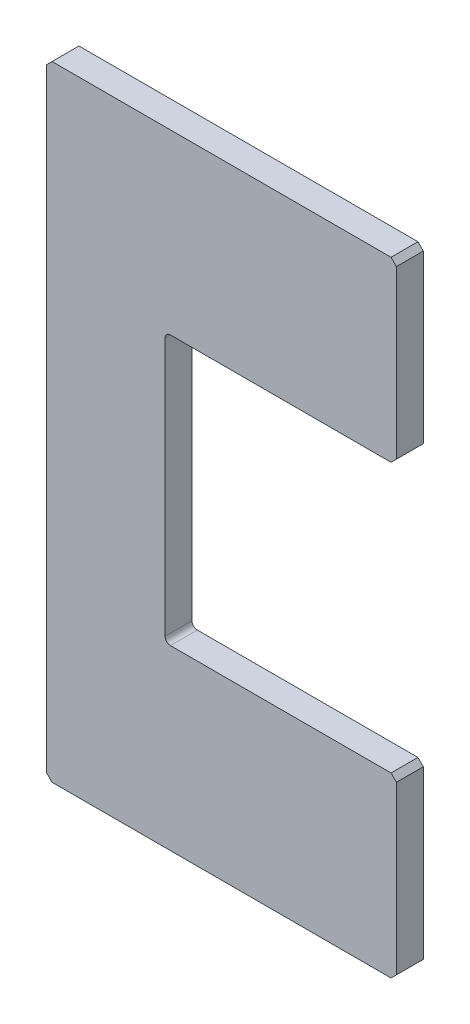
ISO-10303-21;
HEADER;
FILE_DESCRIPTION(('STEP AP214'),'2;1');
FILE_NAME('part.step','',(''),(''),'','','');
FILE_SCHEMA(('AUTOMOTIVE_DESIGN { 1 0 10303 214 1 1 1 1 }'));
ENDSEC;
DATA;
#1=APPLICATION_CONTEXT('core data for automotive mechanical design processes');
#2=APPLICATION_PROTOCOL_DEFINITION('international standard','automotive_design',2000,#1);
#3=PRODUCT_CONTEXT('',#1,'mechanical');
#4=PRODUCT('Part','Part','',(#3));
#5=PRODUCT_RELATED_PRODUCT_CATEGORY('part','',(#4));
#6=PRODUCT_DEFINITION_FORMATION('','',#4);
#7=PRODUCT_DEFINITION_CONTEXT('part definition',#1,'design');
#8=PRODUCT_DEFINITION('design','',#6,#7);
#9=PRODUCT_DEFINITION_SHAPE('','',#8);
#10=(LENGTH_UNIT() NAMED_UNIT(*) SI_UNIT(.MILLI.,.METRE.));
#11=(NAMED_UNIT(*) PLANE_ANGLE_UNIT() SI_UNIT($,.RADIAN.));
#12=(NAMED_UNIT(*) SI_UNIT($,.STERADIAN.) SOLID_ANGLE_UNIT());
#13=UNCERTAINTY_MEASURE_WITH_UNIT(LENGTH_MEASURE(1.E-05),#10,'distance_accuracy_value','');
#14=(GEOMETRIC_REPRESENTATION_CONTEXT(3) GLOBAL_UNCERTAINTY_ASSIGNED_CONTEXT((#13)) GLOBAL_UNIT_ASSIGNED_CONTEXT((#10,
#11,#12)) REPRESENTATION_CONTEXT('',''));
#15=CARTESIAN_POINT('',(0.,0.,0.));
#16=DIRECTION('',(0.,0.,1.));
#17=DIRECTION('',(1.,0.,0.));
#18=AXIS2_PLACEMENT_3D('',#15,#16,#17);
#19=CARTESIAN_POINT('',(0.,-11.6,0.5));
#20=DIRECTION('',(1.,0.,0.));
#21=DIRECTION('',(0.,0.,-1.));
#22=AXIS2_PLACEMENT_3D('',#19,#20,#21);
#23=PLANE('',#22);
#24=DIRECTION('',(0.,-1.,0.));
#25=VECTOR('',#24,1.);
#26=CARTESIAN_POINT('',(0.,-11.6,0.5));
#27=LINE('',#26,#25);
#28=CARTESIAN_POINT('',(0.,-0.0999999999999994,0.5));
#29=VERTEX_POINT('',#28);
#30=CARTESIAN_POINT('',(0.,-11.5,0.5));
#31=VERTEX_POINT('',#30);
#32=EDGE_CURVE('E212',#29,#31,#27,.T.);
#33=ORIENTED_EDGE('',*,*,#32,.F.);
#34=DIRECTION('',(0.,0.,-1.));
#35=VECTOR('',#34,1.);
#36=CARTESIAN_POINT('',(0.,-0.0999999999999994,0.5));
#37=LINE('',#36,#35);
#38=CARTESIAN_POINT('',(0.,-0.0999999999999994,0.));
#39=VERTEX_POINT('',#38);
#40=EDGE_CURVE('E231',#29,#39,#37,.T.);
#41=ORIENTED_EDGE('',*,*,#40,.T.);
#42=DIRECTION('',(0.,-1.,0.));
#43=VECTOR('',#42,1.);
#44=CARTESIAN_POINT('',(0.,-11.6,0.));
#45=LINE('',#44,#43);
#46=CARTESIAN_POINT('',(0.,-11.5,0.));
#47=VERTEX_POINT('',#46);
#48=EDGE_CURVE('E327',#39,#47,#45,.T.);
#49=ORIENTED_EDGE('',*,*,#48,.T.);
#50=DIRECTION('',(0.,0.,1.));
#51=VECTOR('',#50,1.);
#52=CARTESIAN_POINT('',(0.,-11.5,0.5));
#53=LINE('',#52,#51);
#54=EDGE_CURVE('E228',#47,#31,#53,.T.);
#55=ORIENTED_EDGE('',*,*,#54,.T.);
#56=EDGE_LOOP('',(#33,#41,#49,#55));
#57=FACE_BOUND('',#56,.T.);
#58=ADVANCED_FACE('F47',(#57),#23,.F.);
#59=CARTESIAN_POINT('',(6.5,-11.6,0.5));
#60=DIRECTION('',(0.,1.,0.));
#61=DIRECTION('',(0.,0.,1.));
#62=AXIS2_PLACEMENT_3D('',#59,#60,#61);
#63=PLANE('',#62);
#64=DIRECTION('',(1.,0.,0.));
#65=VECTOR('',#64,1.);
#66=CARTESIAN_POINT('',(6.5,-11.6,0.5));
#67=LINE('',#66,#65);
#68=CARTESIAN_POINT('',(0.0999999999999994,-11.6,0.5));
#69=VERTEX_POINT('',#68);
#70=CARTESIAN_POINT('',(6.4,-11.6,0.5));
#71=VERTEX_POINT('',#70);
#72=EDGE_CURVE('E316',#69,#71,#67,.T.);
#73=ORIENTED_EDGE('',*,*,#72,.F.);
#74=DIRECTION('',(0.,0.,-1.));
#75=VECTOR('',#74,1.);
#76=CARTESIAN_POINT('',(0.0999999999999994,-11.6,0.5));
#77=LINE('',#76,#75);
#78=CARTESIAN_POINT('',(0.0999999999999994,-11.6,0.));
#79=VERTEX_POINT('',#78);
#80=EDGE_CURVE('E280',#69,#79,#77,.T.);
#81=ORIENTED_EDGE('',*,*,#80,.T.);
#82=DIRECTION('',(1.,0.,0.));
#83=VECTOR('',#82,1.);
#84=CARTESIAN_POINT('',(6.5,-11.6,0.));
#85=LINE('',#84,#83);
#86=CARTESIAN_POINT('',(6.4,-11.6,0.));
#87=VERTEX_POINT('',#86);
#88=EDGE_CURVE('E325',#79,#87,#85,.T.);
#89=ORIENTED_EDGE('',*,*,#88,.T.);
#90=DIRECTION('',(0.,0.,1.));
#91=VECTOR('',#90,1.);
#92=CARTESIAN_POINT('',(6.4,-11.6,0.5));
#93=LINE('',#92,#91);
#94=EDGE_CURVE('E277',#87,#71,#93,.T.);
#95=ORIENTED_EDGE('',*,*,#94,.T.);
#96=EDGE_LOOP('',(#73,#81,#89,#95));
#97=FACE_BOUND('',#96,.T.);
#98=ADVANCED_FACE('F360',(#97),#63,.F.);
#99=CARTESIAN_POINT('',(6.5,-8.3,0.5));
#100=DIRECTION('',(-1.,0.,0.));
#101=DIRECTION('',(0.,-1.,0.));
#102=AXIS2_PLACEMENT_3D('',#99,#100,#101);
#103=PLANE('',#102);
#104=DIRECTION('',(0.,1.,0.));
#105=VECTOR('',#104,1.);
#106=CARTESIAN_POINT('',(6.5,-8.3,0.));
#107=LINE('',#106,#105);
#108=CARTESIAN_POINT('',(6.5,-11.5,0.));
#109=VERTEX_POINT('',#108);
#110=CARTESIAN_POINT('',(6.5,-8.4,0.));
#111=VERTEX_POINT('',#110);
#112=EDGE_CURVE('E202',#109,#111,#107,.T.);
#113=ORIENTED_EDGE('',*,*,#112,.T.);
#114=DIRECTION('',(0.,0.,1.));
#115=VECTOR('',#114,1.);
#116=CARTESIAN_POINT('',(6.5,-8.4,0.5));
#117=LINE('',#116,#115);
#118=CARTESIAN_POINT('',(6.5,-8.4,0.5));
#119=VERTEX_POINT('',#118);
#120=EDGE_CURVE('E57',#111,#119,#117,.T.);
#121=ORIENTED_EDGE('',*,*,#120,.T.);
#122=DIRECTION('',(0.,1.,0.));
#123=VECTOR('',#122,1.);
#124=CARTESIAN_POINT('',(6.5,-8.3,0.5));
#125=LINE('',#124,#123);
#126=CARTESIAN_POINT('',(6.5,-11.5,0.5));
#127=VERTEX_POINT('',#126);
#128=EDGE_CURVE('E304',#127,#119,#125,.T.);
#129=ORIENTED_EDGE('',*,*,#128,.F.);
#130=DIRECTION('',(0.,0.,-1.));
#131=VECTOR('',#130,1.);
#132=CARTESIAN_POINT('',(6.5,-11.5,0.5));
#133=LINE('',#132,#131);
#134=EDGE_CURVE('E294',#127,#109,#133,.T.);
#135=ORIENTED_EDGE('',*,*,#134,.T.);
#136=EDGE_LOOP('',(#113,#121,#129,#135));
#137=FACE_BOUND('',#136,.T.);
#138=ADVANCED_FACE('F303',(#137),#103,.F.);
#139=CARTESIAN_POINT('',(2.2,-8.3,0.5));
#140=DIRECTION('',(0.,-1.,0.));
#141=DIRECTION('',(0.,0.,-1.));
#142=AXIS2_PLACEMENT_3D('',#139,#140,#141);
#143=PLANE('',#142);
#144=DIRECTION('',(-1.,0.,0.));
#145=VECTOR('',#144,1.);
#146=CARTESIAN_POINT('',(2.2,-8.3,0.5));
#147=LINE('',#146,#145);
#148=CARTESIAN_POINT('',(6.4,-8.3,0.5));
#149=VERTEX_POINT('',#148);
#150=CARTESIAN_POINT('',(2.3,-8.3,0.5));
#151=VERTEX_POINT('',#150);
#152=EDGE_CURVE('E315',#149,#151,#147,.T.);
#153=ORIENTED_EDGE('',*,*,#152,.F.);
#154=DIRECTION('',(0.,0.,-1.));
#155=VECTOR('',#154,1.);
#156=CARTESIAN_POINT('',(6.4,-8.3,0.5));
#157=LINE('',#156,#155);
#158=CARTESIAN_POINT('',(6.4,-8.3,0.));
#159=VERTEX_POINT('',#158);
#160=EDGE_CURVE('E290',#149,#159,#157,.T.);
#161=ORIENTED_EDGE('',*,*,#160,.T.);
#162=DIRECTION('',(-1.,0.,0.));
#163=VECTOR('',#162,1.);
#164=CARTESIAN_POINT('',(2.2,-8.3,0.));
#165=LINE('',#164,#163);
#166=CARTESIAN_POINT('',(2.3,-8.3,0.));
#167=VERTEX_POINT('',#166);
#168=EDGE_CURVE('E195',#159,#167,#165,.T.);
#169=ORIENTED_EDGE('',*,*,#168,.T.);
#170=DIRECTION('',(0.,0.,-1.));
#171=VECTOR('',#170,1.);
#172=CARTESIAN_POINT('',(2.3,-8.3,0.5));
#173=LINE('',#172,#171);
#174=EDGE_CURVE('E170',#167,#151,#173,.F.);
#175=ORIENTED_EDGE('',*,*,#174,.T.);
#176=EDGE_LOOP('',(#153,#161,#169,#175));
#177=FACE_BOUND('',#176,.T.);
#178=ADVANCED_FACE('F321',(#177),#143,.F.);
#179=CARTESIAN_POINT('',(2.2,-3.3,0.5));
#180=DIRECTION('',(-1.,0.,0.));
#181=DIRECTION('',(0.,-1.,0.));
#182=AXIS2_PLACEMENT_3D('',#179,#180,#181);
#183=PLANE('',#182);
#184=DIRECTION('',(0.,1.,0.));
#185=VECTOR('',#184,1.);
#186=CARTESIAN_POINT('',(2.2,-3.3,0.5));
#187=LINE('',#186,#185);
#188=CARTESIAN_POINT('',(2.2,-8.2,0.5));
#189=VERTEX_POINT('',#188);
#190=CARTESIAN_POINT('',(2.2,-3.4,0.5));
#191=VERTEX_POINT('',#190);
#192=EDGE_CURVE('E185',#189,#191,#187,.T.);
#193=ORIENTED_EDGE('',*,*,#192,.F.);
#194=DIRECTION('',(0.,0.,-1.));
#195=VECTOR('',#194,1.);
#196=CARTESIAN_POINT('',(2.2,-8.2,0.));
#197=LINE('',#196,#195);
#198=CARTESIAN_POINT('',(2.2,-8.2,0.));
#199=VERTEX_POINT('',#198);
#200=EDGE_CURVE('E168',#189,#199,#197,.T.);
#201=ORIENTED_EDGE('',*,*,#200,.T.);
#202=DIRECTION('',(0.,1.,0.));
#203=VECTOR('',#202,1.);
#204=CARTESIAN_POINT('',(2.2,-3.3,0.));
#205=LINE('',#204,#203);
#206=CARTESIAN_POINT('',(2.2,-3.4,0.));
#207=VERTEX_POINT('',#206);
#208=EDGE_CURVE('E182',#199,#207,#205,.T.);
#209=ORIENTED_EDGE('',*,*,#208,.T.);
#210=DIRECTION('',(0.,0.,-1.));
#211=VECTOR('',#210,1.);
#212=CARTESIAN_POINT('',(2.2,-3.4,0.5));
#213=LINE('',#212,#211);
#214=EDGE_CURVE('E187',#207,#191,#213,.F.);
#215=ORIENTED_EDGE('',*,*,#214,.T.);
#216=EDGE_LOOP('',(#193,#201,#209,#215));
#217=FACE_BOUND('',#216,.T.);
#218=ADVANCED_FACE('F181',(#217),#183,.F.);
#219=CARTESIAN_POINT('',(6.5,-3.3,0.5));
#220=DIRECTION('',(0.,1.,0.));
#221=DIRECTION('',(-1.,0.,0.));
#222=AXIS2_PLACEMENT_3D('',#219,#220,#221);
#223=PLANE('',#222);
#224=DIRECTION('',(1.,0.,0.));
#225=VECTOR('',#224,1.);
#226=CARTESIAN_POINT('',(6.5,-3.3,0.));
#227=LINE('',#226,#225);
#228=CARTESIAN_POINT('',(2.3,-3.3,0.));
#229=VERTEX_POINT('',#228);
#230=CARTESIAN_POINT('',(6.4,-3.3,0.));
#231=VERTEX_POINT('',#230);
#232=EDGE_CURVE('E194',#229,#231,#227,.T.);
#233=ORIENTED_EDGE('',*,*,#232,.T.);
#234=DIRECTION('',(0.,0.,1.));
#235=VECTOR('',#234,1.);
#236=CARTESIAN_POINT('',(6.4,-3.3,0.5));
#237=LINE('',#236,#235);
#238=CARTESIAN_POINT('',(6.4,-3.3,0.5));
#239=VERTEX_POINT('',#238);
#240=EDGE_CURVE('E11',#231,#239,#237,.T.);
#241=ORIENTED_EDGE('',*,*,#240,.T.);
#242=DIRECTION('',(1.,0.,0.));
#243=VECTOR('',#242,1.);
#244=CARTESIAN_POINT('',(6.5,-3.3,0.5));
#245=LINE('',#244,#243);
#246=CARTESIAN_POINT('',(2.3,-3.3,0.5));
#247=VERTEX_POINT('',#246);
#248=EDGE_CURVE('E338',#247,#239,#245,.T.);
#249=ORIENTED_EDGE('',*,*,#248,.F.);
#250=DIRECTION('',(0.,0.,-1.));
#251=VECTOR('',#250,1.);
#252=CARTESIAN_POINT('',(2.3,-3.3,0.));
#253=LINE('',#252,#251);
#254=EDGE_CURVE('E176',#247,#229,#253,.T.);
#255=ORIENTED_EDGE('',*,*,#254,.T.);
#256=EDGE_LOOP('',(#233,#241,#249,#255));
#257=FACE_BOUND('',#256,.T.);
#258=ADVANCED_FACE('F380',(#257),#223,.F.);
#259=CARTESIAN_POINT('',(6.5,0.,0.5));
#260=DIRECTION('',(-1.,0.,0.));
#261=DIRECTION('',(0.,0.,1.));
#262=AXIS2_PLACEMENT_3D('',#259,#260,#261);
#263=PLANE('',#262);
#264=DIRECTION('',(0.,1.,0.));
#265=VECTOR('',#264,1.);
#266=CARTESIAN_POINT('',(6.5,0.,0.));
#267=LINE('',#266,#265);
#268=CARTESIAN_POINT('',(6.5,-3.2,0.));
#269=VERTEX_POINT('',#268);
#270=CARTESIAN_POINT('',(6.5,-0.0999999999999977,0.));
#271=VERTEX_POINT('',#270);
#272=EDGE_CURVE('E200',#269,#271,#267,.T.);
#273=ORIENTED_EDGE('',*,*,#272,.T.);
#274=DIRECTION('',(0.,0.,1.));
#275=VECTOR('',#274,1.);
#276=CARTESIAN_POINT('',(6.5,-0.0999999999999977,0.5));
#277=LINE('',#276,#275);
#278=CARTESIAN_POINT('',(6.5,-0.0999999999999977,0.5));
#279=VERTEX_POINT('',#278);
#280=EDGE_CURVE('E64',#271,#279,#277,.T.);
#281=ORIENTED_EDGE('',*,*,#280,.T.);
#282=DIRECTION('',(0.,1.,0.));
#283=VECTOR('',#282,1.);
#284=CARTESIAN_POINT('',(6.5,0.,0.5));
#285=LINE('',#284,#283);
#286=CARTESIAN_POINT('',(6.5,-3.2,0.5));
#287=VERTEX_POINT('',#286);
#288=EDGE_CURVE('E335',#287,#279,#285,.T.);
#289=ORIENTED_EDGE('',*,*,#288,.F.);
#290=DIRECTION('',(0.,0.,-1.));
#291=VECTOR('',#290,1.);
#292=CARTESIAN_POINT('',(6.5,-3.2,0.5));
#293=LINE('',#292,#291);
#294=EDGE_CURVE('E284',#287,#269,#293,.T.);
#295=ORIENTED_EDGE('',*,*,#294,.T.);
#296=EDGE_LOOP('',(#273,#281,#289,#295));
#297=FACE_BOUND('',#296,.T.);
#298=ADVANCED_FACE('F374',(#297),#263,.F.);
#299=CARTESIAN_POINT('',(0.,0.,0.5));
#300=DIRECTION('',(0.,-1.,0.));
#301=DIRECTION('',(0.,0.,-1.));
#302=AXIS2_PLACEMENT_3D('',#299,#300,#301);
#303=PLANE('',#302);
#304=DIRECTION('',(-1.,0.,0.));
#305=VECTOR('',#304,1.);
#306=CARTESIAN_POINT('',(0.,0.,0.));
#307=LINE('',#306,#305);
#308=CARTESIAN_POINT('',(6.4,0.,0.));
#309=VERTEX_POINT('',#308);
#310=CARTESIAN_POINT('',(0.0999999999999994,0.,0.));
#311=VERTEX_POINT('',#310);
#312=EDGE_CURVE('E208',#309,#311,#307,.T.);
#313=ORIENTED_EDGE('',*,*,#312,.T.);
#314=DIRECTION('',(0.,0.,1.));
#315=VECTOR('',#314,1.);
#316=CARTESIAN_POINT('',(0.0999999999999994,0.,0.5));
#317=LINE('',#316,#315);
#318=CARTESIAN_POINT('',(0.0999999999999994,0.,0.5));
#319=VERTEX_POINT('',#318);
#320=EDGE_CURVE('E257',#311,#319,#317,.T.);
#321=ORIENTED_EDGE('',*,*,#320,.T.);
#322=DIRECTION('',(-1.,0.,0.));
#323=VECTOR('',#322,1.);
#324=CARTESIAN_POINT('',(0.,0.,0.5));
#325=LINE('',#324,#323);
#326=CARTESIAN_POINT('',(6.4,0.,0.5));
#327=VERTEX_POINT('',#326);
#328=EDGE_CURVE('E214',#327,#319,#325,.T.);
#329=ORIENTED_EDGE('',*,*,#328,.F.);
#330=DIRECTION('',(0.,0.,-1.));
#331=VECTOR('',#330,1.);
#332=CARTESIAN_POINT('',(6.4,0.,0.5));
#333=LINE('',#332,#331);
#334=EDGE_CURVE('E253',#327,#309,#333,.T.);
#335=ORIENTED_EDGE('',*,*,#334,.T.);
#336=EDGE_LOOP('',(#313,#321,#329,#335));
#337=FACE_BOUND('',#336,.T.);
#338=ADVANCED_FACE('F367',(#337),#303,.F.);
#339=CARTESIAN_POINT('',(0.,0.,0.5));
#340=DIRECTION('',(0.,0.,-1.));
#341=DIRECTION('',(-1.,0.,0.));
#342=AXIS2_PLACEMENT_3D('',#339,#340,#341);
#343=PLANE('',#342);
#344=ORIENTED_EDGE('',*,*,#328,.T.);
#345=DIRECTION('',(0.707106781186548,0.707106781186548,0.));
#346=VECTOR('',#345,1.);
#347=CARTESIAN_POINT('',(0.,-0.0999999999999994,0.5));
#348=LINE('',#347,#346);
#349=EDGE_CURVE('E274',#319,#29,#348,.F.);
#350=ORIENTED_EDGE('',*,*,#349,.T.);
#351=ORIENTED_EDGE('',*,*,#32,.T.);
#352=DIRECTION('',(-0.707106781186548,0.707106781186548,0.));
#353=VECTOR('',#352,1.);
#354=CARTESIAN_POINT('',(0.0999999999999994,-11.6,0.5));
#355=LINE('',#354,#353);
#356=EDGE_CURVE('E271',#31,#69,#355,.F.);
#357=ORIENTED_EDGE('',*,*,#356,.T.);
#358=ORIENTED_EDGE('',*,*,#72,.T.);
#359=DIRECTION('',(-0.707106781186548,-0.707106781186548,0.));
#360=VECTOR('',#359,1.);
#361=CARTESIAN_POINT('',(6.5,-11.5,0.5));
#362=LINE('',#361,#360);
#363=EDGE_CURVE('E260',#71,#127,#362,.F.);
#364=ORIENTED_EDGE('',*,*,#363,.T.);
#365=ORIENTED_EDGE('',*,*,#128,.T.);
#366=DIRECTION('',(0.707106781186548,-0.707106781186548,0.));
#367=VECTOR('',#366,1.);
#368=CARTESIAN_POINT('',(6.4,-8.3,0.5));
#369=LINE('',#368,#367);
#370=EDGE_CURVE('E265',#119,#149,#369,.F.);
#371=ORIENTED_EDGE('',*,*,#370,.T.);
#372=ORIENTED_EDGE('',*,*,#152,.T.);
#373=CARTESIAN_POINT('',(2.3,-8.2,0.5));
#374=DIRECTION('',(0.,0.,-1.));
#375=DIRECTION('',(-1.,0.,0.));
#376=AXIS2_PLACEMENT_3D('',#373,#374,#375);
#377=CIRCLE('',#376,0.1);
#378=EDGE_CURVE('E175',#151,#189,#377,.T.);
#379=ORIENTED_EDGE('',*,*,#378,.T.);
#380=ORIENTED_EDGE('',*,*,#192,.T.);
#381=CARTESIAN_POINT('',(2.3,-3.4,0.5));
#382=DIRECTION('',(0.,0.,-1.));
#383=DIRECTION('',(-1.,0.,0.));
#384=AXIS2_PLACEMENT_3D('',#381,#382,#383);
#385=CIRCLE('',#384,0.1);
#386=EDGE_CURVE('E225',#191,#247,#385,.T.);
#387=ORIENTED_EDGE('',*,*,#386,.T.);
#388=ORIENTED_EDGE('',*,*,#248,.T.);
#389=DIRECTION('',(-0.707106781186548,-0.707106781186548,0.));
#390=VECTOR('',#389,1.);
#391=CARTESIAN_POINT('',(6.5,-3.2,0.5));
#392=LINE('',#391,#390);
#393=EDGE_CURVE('E71',#239,#287,#392,.F.);
#394=ORIENTED_EDGE('',*,*,#393,.T.);
#395=ORIENTED_EDGE('',*,*,#288,.T.);
#396=DIRECTION('',(0.707106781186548,-0.707106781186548,0.));
#397=VECTOR('',#396,1.);
#398=CARTESIAN_POINT('',(6.4,0.,0.5));
#399=LINE('',#398,#397);
#400=EDGE_CURVE('E268',#279,#327,#399,.F.);
#401=ORIENTED_EDGE('',*,*,#400,.T.);
#402=EDGE_LOOP('',(#344,#350,#351,#357,#358,#364,#365,#371,#372,#379,#380,#387,#388,#394,#395,#401));
#403=FACE_BOUND('',#402,.T.);
#404=ADVANCED_FACE('F310',(#403),#343,.F.);
#405=CARTESIAN_POINT('',(0.,0.,0.));
#406=DIRECTION('',(0.,0.,-1.));
#407=DIRECTION('',(-1.,0.,0.));
#408=AXIS2_PLACEMENT_3D('',#405,#406,#407);
#409=PLANE('',#408);
#410=ORIENTED_EDGE('',*,*,#48,.F.);
#411=DIRECTION('',(-0.707106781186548,-0.707106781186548,0.));
#412=VECTOR('',#411,1.);
#413=CARTESIAN_POINT('',(0.0499999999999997,-0.0499999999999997,0.));
#414=LINE('',#413,#412);
#415=EDGE_CURVE('E250',#39,#311,#414,.F.);
#416=ORIENTED_EDGE('',*,*,#415,.T.);
#417=ORIENTED_EDGE('',*,*,#312,.F.);
#418=DIRECTION('',(-0.707106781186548,0.707106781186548,0.));
#419=VECTOR('',#418,1.);
#420=CARTESIAN_POINT('',(3.2,3.2,0.));
#421=LINE('',#420,#419);
#422=EDGE_CURVE('E244',#309,#271,#421,.F.);
#423=ORIENTED_EDGE('',*,*,#422,.T.);
#424=ORIENTED_EDGE('',*,*,#272,.F.);
#425=DIRECTION('',(0.707106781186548,0.707106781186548,0.));
#426=VECTOR('',#425,1.);
#427=CARTESIAN_POINT('',(4.85,-4.85,0.));
#428=LINE('',#427,#426);
#429=EDGE_CURVE('E238',#269,#231,#428,.F.);
#430=ORIENTED_EDGE('',*,*,#429,.T.);
#431=ORIENTED_EDGE('',*,*,#232,.F.);
#432=CARTESIAN_POINT('',(2.3,-3.4,0.));
#433=DIRECTION('',(0.,0.,-1.));
#434=DIRECTION('',(-1.,0.,0.));
#435=AXIS2_PLACEMENT_3D('',#432,#433,#434);
#436=CIRCLE('',#435,0.1);
#437=EDGE_CURVE('E192',#229,#207,#436,.F.);
#438=ORIENTED_EDGE('',*,*,#437,.T.);
#439=ORIENTED_EDGE('',*,*,#208,.F.);
#440=CARTESIAN_POINT('',(2.3,-8.2,0.));
#441=DIRECTION('',(0.,0.,-1.));
#442=DIRECTION('',(-1.,0.,0.));
#443=AXIS2_PLACEMENT_3D('',#440,#441,#442);
#444=CIRCLE('',#443,0.1);
#445=EDGE_CURVE('E164',#199,#167,#444,.F.);
#446=ORIENTED_EDGE('',*,*,#445,.T.);
#447=ORIENTED_EDGE('',*,*,#168,.F.);
#448=DIRECTION('',(-0.707106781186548,0.707106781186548,0.));
#449=VECTOR('',#448,1.);
#450=CARTESIAN_POINT('',(-0.949999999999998,-0.949999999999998,0.));
#451=LINE('',#450,#449);
#452=EDGE_CURVE('E241',#159,#111,#451,.F.);
#453=ORIENTED_EDGE('',*,*,#452,.T.);
#454=ORIENTED_EDGE('',*,*,#112,.F.);
#455=DIRECTION('',(0.707106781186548,0.707106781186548,0.));
#456=VECTOR('',#455,1.);
#457=CARTESIAN_POINT('',(9.,-9.,0.));
#458=LINE('',#457,#456);
#459=EDGE_CURVE('E235',#109,#87,#458,.F.);
#460=ORIENTED_EDGE('',*,*,#459,.T.);
#461=ORIENTED_EDGE('',*,*,#88,.F.);
#462=DIRECTION('',(0.707106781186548,-0.707106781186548,0.));
#463=VECTOR('',#462,1.);
#464=CARTESIAN_POINT('',(-5.75,-5.75,0.));
#465=LINE('',#464,#463);
#466=EDGE_CURVE('E247',#79,#47,#465,.F.);
#467=ORIENTED_EDGE('',*,*,#466,.T.);
#468=EDGE_LOOP('',(#410,#416,#417,#423,#424,#430,#431,#438,#439,#446,#447,#453,#454,#460,#461,#467));
#469=FACE_BOUND('',#468,.T.);
#470=ADVANCED_FACE('F190',(#469),#409,.T.);
#471=CARTESIAN_POINT('',(2.3,-8.2,0.5));
#472=DIRECTION('',(0.,0.,1.));
#473=DIRECTION('',(1.,0.,0.));
#474=AXIS2_PLACEMENT_3D('',#471,#472,#473);
#475=CYLINDRICAL_SURFACE('',#474,0.1);
#476=ORIENTED_EDGE('',*,*,#378,.F.);
#477=ORIENTED_EDGE('',*,*,#174,.F.);
#478=ORIENTED_EDGE('',*,*,#445,.F.);
#479=ORIENTED_EDGE('',*,*,#200,.F.);
#480=EDGE_LOOP('',(#476,#477,#478,#479));
#481=FACE_BOUND('',#480,.T.);
#482=ADVANCED_FACE('F167',(#481),#475,.F.);
#483=CARTESIAN_POINT('',(2.3,-3.4,0.5));
#484=DIRECTION('',(0.,0.,1.));
#485=DIRECTION('',(1.,0.,0.));
#486=AXIS2_PLACEMENT_3D('',#483,#484,#485);
#487=CYLINDRICAL_SURFACE('',#486,0.1);
#488=ORIENTED_EDGE('',*,*,#386,.F.);
#489=ORIENTED_EDGE('',*,*,#214,.F.);
#490=ORIENTED_EDGE('',*,*,#437,.F.);
#491=ORIENTED_EDGE('',*,*,#254,.F.);
#492=EDGE_LOOP('',(#488,#489,#490,#491));
#493=FACE_BOUND('',#492,.T.);
#494=ADVANCED_FACE('F385',(#493),#487,.F.);
#495=CARTESIAN_POINT('',(0.,-0.0999999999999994,0.5));
#496=DIRECTION('',(0.707106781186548,-0.707106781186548,0.));
#497=DIRECTION('',(0.,0.,-1.));
#498=AXIS2_PLACEMENT_3D('',#495,#496,#497);
#499=PLANE('',#498);
#500=ORIENTED_EDGE('',*,*,#349,.F.);
#501=ORIENTED_EDGE('',*,*,#320,.F.);
#502=ORIENTED_EDGE('',*,*,#415,.F.);
#503=ORIENTED_EDGE('',*,*,#40,.F.);
#504=EDGE_LOOP('',(#500,#501,#502,#503));
#505=FACE_BOUND('',#504,.T.);
#506=ADVANCED_FACE('F363',(#505),#499,.F.);
#507=CARTESIAN_POINT('',(0.0999999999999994,-11.6,0.5));
#508=DIRECTION('',(0.707106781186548,0.707106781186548,0.));
#509=DIRECTION('',(0.,0.,-1.));
#510=AXIS2_PLACEMENT_3D('',#507,#508,#509);
#511=PLANE('',#510);
#512=ORIENTED_EDGE('',*,*,#356,.F.);
#513=ORIENTED_EDGE('',*,*,#54,.F.);
#514=ORIENTED_EDGE('',*,*,#466,.F.);
#515=ORIENTED_EDGE('',*,*,#80,.F.);
#516=EDGE_LOOP('',(#512,#513,#514,#515));
#517=FACE_BOUND('',#516,.T.);
#518=ADVANCED_FACE('F358',(#517),#511,.F.);
#519=CARTESIAN_POINT('',(6.4,0.,0.5));
#520=DIRECTION('',(-0.707106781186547,-0.707106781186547,0.));
#521=DIRECTION('',(0.,0.,-1.));
#522=AXIS2_PLACEMENT_3D('',#519,#520,#521);
#523=PLANE('',#522);
#524=ORIENTED_EDGE('',*,*,#400,.F.);
#525=ORIENTED_EDGE('',*,*,#280,.F.);
#526=ORIENTED_EDGE('',*,*,#422,.F.);
#527=ORIENTED_EDGE('',*,*,#334,.F.);
#528=EDGE_LOOP('',(#524,#525,#526,#527));
#529=FACE_BOUND('',#528,.T.);
#530=ADVANCED_FACE('F372',(#529),#523,.F.);
#531=CARTESIAN_POINT('',(6.4,-8.3,0.5));
#532=DIRECTION('',(-0.707106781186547,-0.707106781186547,0.));
#533=DIRECTION('',(0.,0.,-1.));
#534=AXIS2_PLACEMENT_3D('',#531,#532,#533);
#535=PLANE('',#534);
#536=ORIENTED_EDGE('',*,*,#370,.F.);
#537=ORIENTED_EDGE('',*,*,#120,.F.);
#538=ORIENTED_EDGE('',*,*,#452,.F.);
#539=ORIENTED_EDGE('',*,*,#160,.F.);
#540=EDGE_LOOP('',(#536,#537,#538,#539));
#541=FACE_BOUND('',#540,.T.);
#542=ADVANCED_FACE('F319',(#541),#535,.F.);
#543=CARTESIAN_POINT('',(6.5,-3.2,0.5));
#544=DIRECTION('',(-0.707106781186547,0.707106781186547,0.));
#545=DIRECTION('',(0.,0.,-1.));
#546=AXIS2_PLACEMENT_3D('',#543,#544,#545);
#547=PLANE('',#546);
#548=ORIENTED_EDGE('',*,*,#393,.F.);
#549=ORIENTED_EDGE('',*,*,#240,.F.);
#550=ORIENTED_EDGE('',*,*,#429,.F.);
#551=ORIENTED_EDGE('',*,*,#294,.F.);
#552=EDGE_LOOP('',(#548,#549,#550,#551));
#553=FACE_BOUND('',#552,.T.);
#554=ADVANCED_FACE('F377',(#553),#547,.F.);
#555=CARTESIAN_POINT('',(6.5,-11.5,0.5));
#556=DIRECTION('',(-0.707106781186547,0.707106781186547,0.));
#557=DIRECTION('',(0.,0.,-1.));
#558=AXIS2_PLACEMENT_3D('',#555,#556,#557);
#559=PLANE('',#558);
#560=ORIENTED_EDGE('',*,*,#363,.F.);
#561=ORIENTED_EDGE('',*,*,#94,.F.);
#562=ORIENTED_EDGE('',*,*,#459,.F.);
#563=ORIENTED_EDGE('',*,*,#134,.F.);
#564=EDGE_LOOP('',(#560,#561,#562,#563));
#565=FACE_BOUND('',#564,.T.);
#566=ADVANCED_FACE('F50',(#565),#559,.F.);
#567=CLOSED_SHELL('',(#58,#98,#138,#178,#218,#258,#298,#338,#404,#470,#482,#494,#506,#518,#530,
#542,#554,#566));
#568=MANIFOLD_SOLID_BREP('B2',#567);
#569=ADVANCED_BREP_SHAPE_REPRESENTATION('',(#18,#568),#14);
#570=SHAPE_DEFINITION_REPRESENTATION(#9,#569);
ENDSEC;
END-ISO-10303-21;
